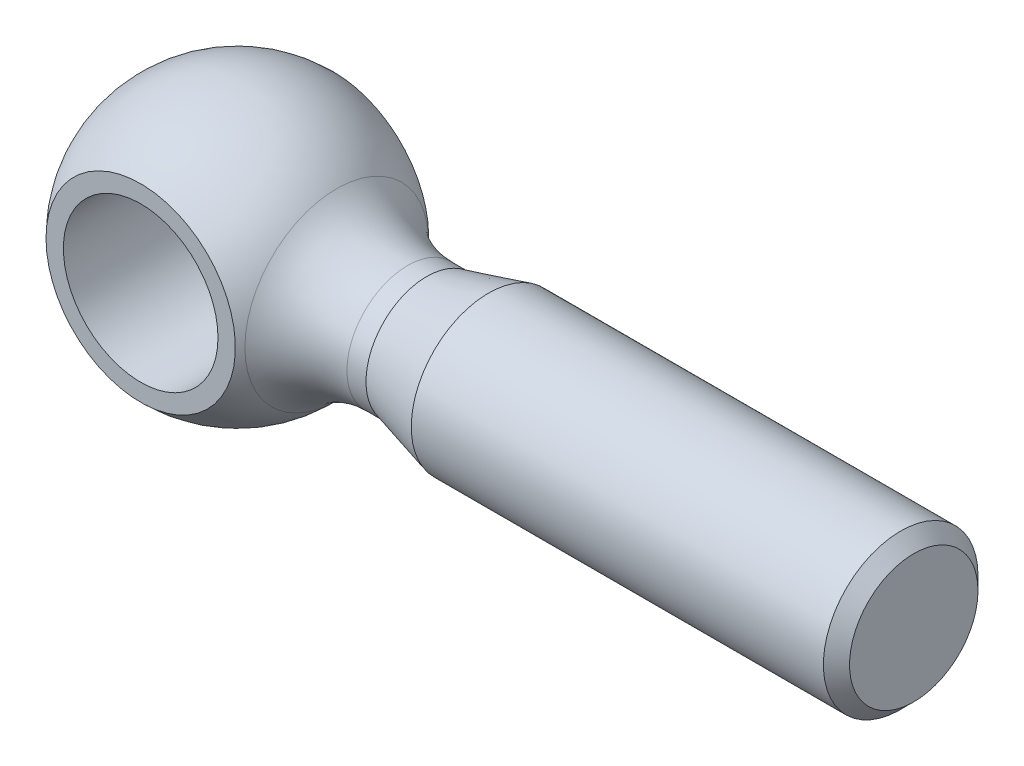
ISO-10303-21;
HEADER;
FILE_DESCRIPTION(('STEP AP214'),'2;1');
FILE_NAME('part.step','',(''),(''),'','','');
FILE_SCHEMA(('AUTOMOTIVE_DESIGN { 1 0 10303 214 1 1 1 1 }'));
ENDSEC;
DATA;
#1=APPLICATION_CONTEXT('core data for automotive mechanical design processes');
#2=APPLICATION_PROTOCOL_DEFINITION('international standard','automotive_design',2000,#1);
#3=PRODUCT_CONTEXT('',#1,'mechanical');
#4=PRODUCT('Part','Part','',(#3));
#5=PRODUCT_RELATED_PRODUCT_CATEGORY('part','',(#4));
#6=PRODUCT_DEFINITION_FORMATION('','',#4);
#7=PRODUCT_DEFINITION_CONTEXT('part definition',#1,'design');
#8=PRODUCT_DEFINITION('design','',#6,#7);
#9=PRODUCT_DEFINITION_SHAPE('','',#8);
#10=(LENGTH_UNIT() NAMED_UNIT(*) SI_UNIT(.MILLI.,.METRE.));
#11=(NAMED_UNIT(*) PLANE_ANGLE_UNIT() SI_UNIT($,.RADIAN.));
#12=(NAMED_UNIT(*) SI_UNIT($,.STERADIAN.) SOLID_ANGLE_UNIT());
#13=UNCERTAINTY_MEASURE_WITH_UNIT(LENGTH_MEASURE(1.E-05),#10,'distance_accuracy_value','');
#14=(GEOMETRIC_REPRESENTATION_CONTEXT(3) GLOBAL_UNCERTAINTY_ASSIGNED_CONTEXT((#13)) GLOBAL_UNIT_ASSIGNED_CONTEXT((#10,
#11,#12)) REPRESENTATION_CONTEXT('',''));
#15=CARTESIAN_POINT('',(0.,0.,0.));
#16=DIRECTION('',(0.,0.,1.));
#17=DIRECTION('',(1.,0.,0.));
#18=AXIS2_PLACEMENT_3D('',#15,#16,#17);
#19=CARTESIAN_POINT('',(35.,0.,0.));
#20=DIRECTION('',(1.,0.,0.));
#21=DIRECTION('',(0.,0.,-1.));
#22=AXIS2_PLACEMENT_3D('',#19,#20,#21);
#23=CYLINDRICAL_SURFACE('',#22,3.14256258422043);
#24=CARTESIAN_POINT('',(8.8146851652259,0.,0.));
#25=DIRECTION('',(-1.,0.,0.));
#26=DIRECTION('',(0.,0.,1.));
#27=AXIS2_PLACEMENT_3D('',#24,#25,#26);
#28=CIRCLE('',#27,3.14256258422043);
#29=CARTESIAN_POINT('',(8.8146851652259,0.,3.14256258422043));
#30=VERTEX_POINT('',#29);
#31=EDGE_CURVE('E10',#30,#30,#28,.F.);
#32=ORIENTED_EDGE('',*,*,#31,.T.);
#33=EDGE_LOOP('',(#32));
#34=FACE_BOUND('',#33,.T.);
#35=CARTESIAN_POINT('',(9.8,0.,0.));
#36=DIRECTION('',(1.,0.,0.));
#37=DIRECTION('',(0.,0.,-1.));
#38=AXIS2_PLACEMENT_3D('',#35,#36,#37);
#39=CIRCLE('',#38,3.14256258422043);
#40=CARTESIAN_POINT('',(9.8,0.,-3.14256258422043));
#41=VERTEX_POINT('',#40);
#42=EDGE_CURVE('E64',#41,#41,#39,.T.);
#43=ORIENTED_EDGE('',*,*,#42,.F.);
#44=EDGE_LOOP('',(#43));
#45=FACE_BOUND('',#44,.T.);
#46=ADVANCED_FACE('F35',(#34,#45),#23,.T.);
#47=CARTESIAN_POINT('',(35.,0.,0.));
#48=DIRECTION('',(-1.,0.,0.));
#49=DIRECTION('',(0.,0.,1.));
#50=AXIS2_PLACEMENT_3D('',#47,#48,#49);
#51=CYLINDRICAL_SURFACE('',#50,4.);
#52=CARTESIAN_POINT('',(34.3235,0.,0.));
#53=DIRECTION('',(1.,0.,0.));
#54=DIRECTION('',(0.,0.,-1.));
#55=AXIS2_PLACEMENT_3D('',#52,#53,#54);
#56=CIRCLE('',#55,4.);
#57=CARTESIAN_POINT('',(34.3235,0.,-4.));
#58=VERTEX_POINT('',#57);
#59=EDGE_CURVE('E46',#58,#58,#56,.F.);
#60=ORIENTED_EDGE('',*,*,#59,.T.);
#61=EDGE_LOOP('',(#60));
#62=FACE_BOUND('',#61,.T.);
#63=CARTESIAN_POINT('',(13.,0.,0.));
#64=DIRECTION('',(1.,0.,0.));
#65=DIRECTION('',(0.,0.,-1.));
#66=AXIS2_PLACEMENT_3D('',#63,#64,#65);
#67=CIRCLE('',#66,4.);
#68=CARTESIAN_POINT('',(13.,0.,-4.));
#69=VERTEX_POINT('',#68);
#70=EDGE_CURVE('E61',#69,#69,#67,.T.);
#71=ORIENTED_EDGE('',*,*,#70,.T.);
#72=EDGE_LOOP('',(#71));
#73=FACE_BOUND('',#72,.T.);
#74=ADVANCED_FACE('F103',(#62,#73),#51,.T.);
#75=CARTESIAN_POINT('',(35.,0.,0.));
#76=DIRECTION('',(1.,0.,0.));
#77=DIRECTION('',(0.,0.,-1.));
#78=AXIS2_PLACEMENT_3D('',#75,#76,#77);
#79=PLANE('',#78);
#80=CARTESIAN_POINT('',(35.,0.,0.));
#81=DIRECTION('',(1.,0.,0.));
#82=DIRECTION('',(0.,0.,-1.));
#83=AXIS2_PLACEMENT_3D('',#80,#81,#82);
#84=CIRCLE('',#83,3.32349999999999);
#85=CARTESIAN_POINT('',(35.,0.,-3.32349999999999));
#86=VERTEX_POINT('',#85);
#87=EDGE_CURVE('E50',#86,#86,#84,.T.);
#88=ORIENTED_EDGE('',*,*,#87,.T.);
#89=EDGE_LOOP('',(#88));
#90=FACE_BOUND('',#89,.T.);
#91=ADVANCED_FACE('F97',(#90),#79,.T.);
#92=CARTESIAN_POINT('',(9.8,0.,0.));
#93=DIRECTION('',(1.,0.,0.));
#94=DIRECTION('',(0.,0.,-1.));
#95=AXIS2_PLACEMENT_3D('',#92,#93,#94);
#96=CONICAL_SURFACE('',#95,3.14256258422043,0.261799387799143);
#97=ORIENTED_EDGE('',*,*,#70,.F.);
#98=EDGE_LOOP('',(#97));
#99=FACE_BOUND('',#98,.T.);
#100=ORIENTED_EDGE('',*,*,#42,.T.);
#101=EDGE_LOOP('',(#100));
#102=FACE_BOUND('',#101,.T.);
#103=ADVANCED_FACE('F92',(#99,#102),#96,.T.);
#104=CARTESIAN_POINT('',(0.,0.,0.));
#105=DIRECTION('',(0.,0.,1.));
#106=DIRECTION('',(-1.,0.,0.));
#107=AXIS2_PLACEMENT_3D('',#104,#105,#106);
#108=SPHERICAL_SURFACE('',#107,7.);
#109=CARTESIAN_POINT('',(5.14189967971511,0.,0.));
#110=DIRECTION('',(-1.,0.,0.));
#111=DIRECTION('',(0.,0.,1.));
#112=AXIS2_PLACEMENT_3D('',#109,#110,#111);
#113=CIRCLE('',#112,4.74982817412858);
#114=CARTESIAN_POINT('',(5.14189967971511,0.,4.74982817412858));
#115=VERTEX_POINT('',#114);
#116=EDGE_CURVE('E42',#115,#115,#113,.T.);
#117=ORIENTED_EDGE('',*,*,#116,.T.);
#118=EDGE_LOOP('',(#117));
#119=FACE_BOUND('',#118,.T.);
#120=CARTESIAN_POINT('',(0.,0.,-5.));
#121=DIRECTION('',(0.,0.,1.));
#122=DIRECTION('',(1.,0.,0.));
#123=AXIS2_PLACEMENT_3D('',#120,#121,#122);
#124=CIRCLE('',#123,4.89897948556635);
#125=CARTESIAN_POINT('',(4.89897948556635,0.,-5.));
#126=VERTEX_POINT('',#125);
#127=EDGE_CURVE('E55',#126,#126,#124,.T.);
#128=ORIENTED_EDGE('',*,*,#127,.T.);
#129=EDGE_LOOP('',(#128));
#130=FACE_BOUND('',#129,.T.);
#131=CARTESIAN_POINT('',(0.,0.,5.));
#132=DIRECTION('',(0.,0.,-1.));
#133=DIRECTION('',(-1.,0.,0.));
#134=AXIS2_PLACEMENT_3D('',#131,#132,#133);
#135=CIRCLE('',#134,4.89897948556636);
#136=CARTESIAN_POINT('',(-4.89897948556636,0.,5.));
#137=VERTEX_POINT('',#136);
#138=EDGE_CURVE('E58',#137,#137,#135,.T.);
#139=ORIENTED_EDGE('',*,*,#138,.T.);
#140=EDGE_LOOP('',(#139));
#141=FACE_BOUND('',#140,.T.);
#142=ADVANCED_FACE('F87',(#119,#130,#141),#108,.T.);
#143=CARTESIAN_POINT('',(-7.,4.89897948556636,5.));
#144=DIRECTION('',(0.,0.,-1.));
#145=DIRECTION('',(-1.,0.,0.));
#146=AXIS2_PLACEMENT_3D('',#143,#144,#145);
#147=PLANE('',#146);
#148=CARTESIAN_POINT('',(0.,0.,5.));
#149=DIRECTION('',(0.,0.,1.));
#150=DIRECTION('',(1.,0.,0.));
#151=AXIS2_PLACEMENT_3D('',#148,#149,#150);
#152=CIRCLE('',#151,4.);
#153=CARTESIAN_POINT('',(4.,0.,5.));
#154=VERTEX_POINT('',#153);
#155=EDGE_CURVE('E68',#154,#154,#152,.T.);
#156=ORIENTED_EDGE('',*,*,#155,.F.);
#157=EDGE_LOOP('',(#156));
#158=FACE_BOUND('',#157,.T.);
#159=ORIENTED_EDGE('',*,*,#138,.F.);
#160=EDGE_LOOP('',(#159));
#161=FACE_BOUND('',#160,.T.);
#162=ADVANCED_FACE('F84',(#158,#161),#147,.F.);
#163=CARTESIAN_POINT('',(-7.,4.89897948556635,-5.));
#164=DIRECTION('',(0.,0.,1.));
#165=DIRECTION('',(1.,0.,0.));
#166=AXIS2_PLACEMENT_3D('',#163,#164,#165);
#167=PLANE('',#166);
#168=CARTESIAN_POINT('',(0.,0.,-5.));
#169=DIRECTION('',(0.,0.,1.));
#170=DIRECTION('',(1.,0.,0.));
#171=AXIS2_PLACEMENT_3D('',#168,#169,#170);
#172=CIRCLE('',#171,4.);
#173=CARTESIAN_POINT('',(4.,0.,-5.));
#174=VERTEX_POINT('',#173);
#175=EDGE_CURVE('E67',#174,#174,#172,.T.);
#176=ORIENTED_EDGE('',*,*,#175,.T.);
#177=EDGE_LOOP('',(#176));
#178=FACE_BOUND('',#177,.T.);
#179=ORIENTED_EDGE('',*,*,#127,.F.);
#180=EDGE_LOOP('',(#179));
#181=FACE_BOUND('',#180,.T.);
#182=ADVANCED_FACE('F74',(#178,#181),#167,.F.);
#183=CARTESIAN_POINT('',(0.,0.,-5.));
#184=DIRECTION('',(0.,0.,1.));
#185=DIRECTION('',(1.,0.,0.));
#186=AXIS2_PLACEMENT_3D('',#183,#184,#185);
#187=CYLINDRICAL_SURFACE('',#186,4.);
#188=ORIENTED_EDGE('',*,*,#175,.F.);
#189=EDGE_LOOP('',(#188));
#190=FACE_BOUND('',#189,.T.);
#191=ORIENTED_EDGE('',*,*,#155,.T.);
#192=EDGE_LOOP('',(#191));
#193=FACE_BOUND('',#192,.T.);
#194=ADVANCED_FACE('F77',(#190,#193),#187,.F.);
#195=CARTESIAN_POINT('',(35.,0.,0.));
#196=DIRECTION('',(-1.,0.,0.));
#197=DIRECTION('',(0.,0.,1.));
#198=AXIS2_PLACEMENT_3D('',#195,#196,#197);
#199=CONICAL_SURFACE('',#198,3.32349999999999,0.785398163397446);
#200=ORIENTED_EDGE('',*,*,#59,.F.);
#201=EDGE_LOOP('',(#200));
#202=FACE_BOUND('',#201,.T.);
#203=ORIENTED_EDGE('',*,*,#87,.F.);
#204=EDGE_LOOP('',(#203));
#205=FACE_BOUND('',#204,.T.);
#206=ADVANCED_FACE('F80',(#202,#205),#199,.T.);
#207=CARTESIAN_POINT('',(8.8146851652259,0.,0.));
#208=DIRECTION('',(-1.,0.,0.));
#209=DIRECTION('',(0.,0.,1.));
#210=AXIS2_PLACEMENT_3D('',#207,#208,#209);
#211=TOROIDAL_SURFACE('',#210,8.14256258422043,5.);
#212=ORIENTED_EDGE('',*,*,#31,.F.);
#213=EDGE_LOOP('',(#212));
#214=FACE_BOUND('',#213,.T.);
#215=ORIENTED_EDGE('',*,*,#116,.F.);
#216=EDGE_LOOP('',(#215));
#217=FACE_BOUND('',#216,.T.);
#218=ADVANCED_FACE('F37',(#214,#217),#211,.F.);
#219=CLOSED_SHELL('',(#46,#74,#91,#103,#142,#162,#182,#194,#206,#218));
#220=MANIFOLD_SOLID_BREP('B2',#219);
#221=ADVANCED_BREP_SHAPE_REPRESENTATION('',(#18,#220),#14);
#222=SHAPE_DEFINITION_REPRESENTATION(#9,#221);
ENDSEC;
END-ISO-10303-21;
